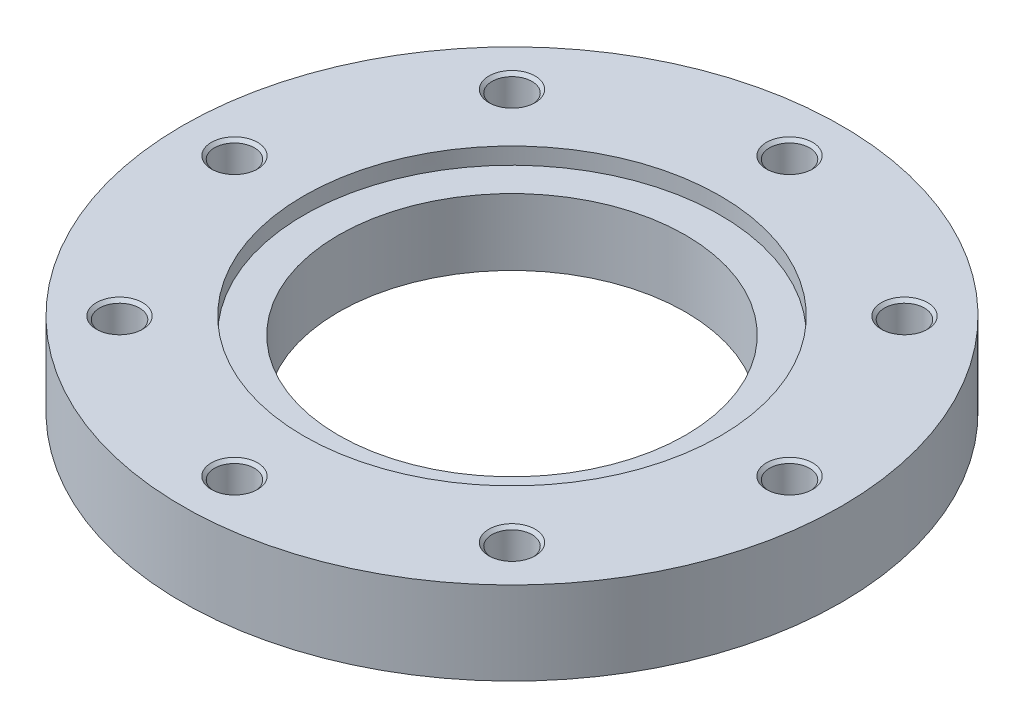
ISO-10303-21;
HEADER;
FILE_DESCRIPTION(('STEP AP214'),'2;1');
FILE_NAME('part.step','',(''),(''),'','','');
FILE_SCHEMA(('AUTOMOTIVE_DESIGN { 1 0 10303 214 1 1 1 1 }'));
ENDSEC;
DATA;
#1=APPLICATION_CONTEXT('core data for automotive mechanical design processes');
#2=APPLICATION_PROTOCOL_DEFINITION('international standard','automotive_design',2000,#1);
#3=PRODUCT_CONTEXT('',#1,'mechanical');
#4=PRODUCT('Part','Part','',(#3));
#5=PRODUCT_RELATED_PRODUCT_CATEGORY('part','',(#4));
#6=PRODUCT_DEFINITION_FORMATION('','',#4);
#7=PRODUCT_DEFINITION_CONTEXT('part definition',#1,'design');
#8=PRODUCT_DEFINITION('design','',#6,#7);
#9=PRODUCT_DEFINITION_SHAPE('','',#8);
#10=(LENGTH_UNIT() NAMED_UNIT(*) SI_UNIT(.MILLI.,.METRE.));
#11=(NAMED_UNIT(*) PLANE_ANGLE_UNIT() SI_UNIT($,.RADIAN.));
#12=(NAMED_UNIT(*) SI_UNIT($,.STERADIAN.) SOLID_ANGLE_UNIT());
#13=UNCERTAINTY_MEASURE_WITH_UNIT(LENGTH_MEASURE(1.E-05),#10,'distance_accuracy_value','');
#14=(GEOMETRIC_REPRESENTATION_CONTEXT(3) GLOBAL_UNCERTAINTY_ASSIGNED_CONTEXT((#13)) GLOBAL_UNIT_ASSIGNED_CONTEXT((#10,
#11,#12)) REPRESENTATION_CONTEXT('',''));
#15=CARTESIAN_POINT('',(0.,0.,0.));
#16=DIRECTION('',(0.,0.,1.));
#17=DIRECTION('',(1.,0.,0.));
#18=AXIS2_PLACEMENT_3D('',#15,#16,#17);
#19=CARTESIAN_POINT('',(0.,18.,0.));
#20=DIRECTION('',(0.,-1.,0.));
#21=DIRECTION('',(1.,0.,0.));
#22=AXIS2_PLACEMENT_3D('',#19,#20,#21);
#23=CYLINDRICAL_SURFACE('',#22,142.5);
#24=CARTESIAN_POINT('',(0.,0.,0.));
#25=DIRECTION('',(0.,1.,0.));
#26=DIRECTION('',(1.,0.,0.));
#27=AXIS2_PLACEMENT_3D('',#24,#25,#26);
#28=CIRCLE('',#27,142.5);
#29=CARTESIAN_POINT('',(142.5,0.,0.));
#30=VERTEX_POINT('',#29);
#31=EDGE_CURVE('E9',#30,#30,#28,.T.);
#32=ORIENTED_EDGE('',*,*,#31,.T.);
#33=EDGE_LOOP('',(#32));
#34=FACE_BOUND('',#33,.T.);
#35=CARTESIAN_POINT('',(0.,36.,0.));
#36=DIRECTION('',(0.,1.,0.));
#37=DIRECTION('',(1.,0.,0.));
#38=AXIS2_PLACEMENT_3D('',#35,#36,#37);
#39=CIRCLE('',#38,142.5);
#40=CARTESIAN_POINT('',(142.5,36.,0.));
#41=VERTEX_POINT('',#40);
#42=EDGE_CURVE('E239',#41,#41,#39,.T.);
#43=ORIENTED_EDGE('',*,*,#42,.F.);
#44=EDGE_LOOP('',(#43));
#45=FACE_BOUND('',#44,.T.);
#46=ADVANCED_FACE('F15',(#34,#45),#23,.T.);
#47=CARTESIAN_POINT('',(108.75,0.,0.));
#48=DIRECTION('',(0.,-1.,0.));
#49=DIRECTION('',(-1.,0.,0.));
#50=AXIS2_PLACEMENT_3D('',#47,#48,#49);
#51=PLANE('',#50);
#52=CARTESIAN_POINT('',(0.,0.,0.));
#53=DIRECTION('',(0.,1.,0.));
#54=DIRECTION('',(1.,0.,0.));
#55=AXIS2_PLACEMENT_3D('',#52,#53,#54);
#56=CIRCLE('',#55,75.);
#57=CARTESIAN_POINT('',(75.,0.,0.));
#58=VERTEX_POINT('',#57);
#59=EDGE_CURVE('E22',#58,#58,#56,.T.);
#60=ORIENTED_EDGE('',*,*,#59,.T.);
#61=EDGE_LOOP('',(#60));
#62=FACE_BOUND('',#61,.T.);
#63=ORIENTED_EDGE('',*,*,#31,.F.);
#64=EDGE_LOOP('',(#63));
#65=FACE_BOUND('',#64,.T.);
#66=ADVANCED_FACE('F268',(#62,#65),#51,.T.);
#67=CARTESIAN_POINT('',(0.,18.,0.));
#68=DIRECTION('',(0.,-1.,0.));
#69=DIRECTION('',(1.,0.,0.));
#70=AXIS2_PLACEMENT_3D('',#67,#68,#69);
#71=CYLINDRICAL_SURFACE('',#70,75.);
#72=ORIENTED_EDGE('',*,*,#59,.F.);
#73=EDGE_LOOP('',(#72));
#74=FACE_BOUND('',#73,.T.);
#75=CARTESIAN_POINT('',(0.,28.8,0.));
#76=DIRECTION('',(0.,1.,0.));
#77=DIRECTION('',(1.,0.,0.));
#78=AXIS2_PLACEMENT_3D('',#75,#76,#77);
#79=CIRCLE('',#78,75.);
#80=CARTESIAN_POINT('',(-75.,28.8,0.));
#81=VERTEX_POINT('',#80);
#82=EDGE_CURVE('E149',#81,#81,#79,.T.);
#83=ORIENTED_EDGE('',*,*,#82,.T.);
#84=EDGE_LOOP('',(#83));
#85=FACE_BOUND('',#84,.T.);
#86=ADVANCED_FACE('F273',(#74,#85),#71,.F.);
#87=CARTESIAN_POINT('',(108.75,36.,0.));
#88=DIRECTION('',(0.,1.,0.));
#89=DIRECTION('',(1.,0.,0.));
#90=AXIS2_PLACEMENT_3D('',#87,#88,#89);
#91=PLANE('',#90);
#92=ORIENTED_EDGE('',*,*,#42,.T.);
#93=EDGE_LOOP('',(#92));
#94=FACE_BOUND('',#93,.T.);
#95=CARTESIAN_POINT('',(0.,36.,0.));
#96=DIRECTION('',(0.,-1.,0.));
#97=DIRECTION('',(1.,0.,0.));
#98=AXIS2_PLACEMENT_3D('',#95,#96,#97);
#99=CIRCLE('',#98,90.);
#100=CARTESIAN_POINT('',(-90.,36.,0.));
#101=VERTEX_POINT('',#100);
#102=EDGE_CURVE('E259',#101,#101,#99,.T.);
#103=ORIENTED_EDGE('',*,*,#102,.T.);
#104=EDGE_LOOP('',(#103));
#105=FACE_BOUND('',#104,.T.);
#106=CARTESIAN_POINT('',(120.,36.,0.));
#107=DIRECTION('',(0.,-1.,0.));
#108=DIRECTION('',(1.,0.,0.));
#109=AXIS2_PLACEMENT_3D('',#106,#107,#108);
#110=CIRCLE('',#109,10.);
#111=CARTESIAN_POINT('',(130.,36.,0.));
#112=VERTEX_POINT('',#111);
#113=EDGE_CURVE('E220',#112,#112,#110,.T.);
#114=ORIENTED_EDGE('',*,*,#113,.T.);
#115=EDGE_LOOP('',(#114));
#116=FACE_BOUND('',#115,.T.);
#117=CARTESIAN_POINT('',(84.8528137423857,36.,-84.8528137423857));
#118=DIRECTION('',(0.,-1.,0.));
#119=DIRECTION('',(0.707106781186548,0.,-0.707106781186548));
#120=AXIS2_PLACEMENT_3D('',#117,#118,#119);
#121=CIRCLE('',#120,10.);
#122=CARTESIAN_POINT('',(91.9238815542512,36.,-91.9238815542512));
#123=VERTEX_POINT('',#122);
#124=EDGE_CURVE('E201',#123,#123,#121,.T.);
#125=ORIENTED_EDGE('',*,*,#124,.T.);
#126=EDGE_LOOP('',(#125));
#127=FACE_BOUND('',#126,.T.);
#128=CARTESIAN_POINT('',(0.,36.,-120.));
#129=DIRECTION('',(0.,-1.,0.));
#130=DIRECTION('',(0.,0.,-1.));
#131=AXIS2_PLACEMENT_3D('',#128,#129,#130);
#132=CIRCLE('',#131,10.);
#133=CARTESIAN_POINT('',(0.,36.,-130.));
#134=VERTEX_POINT('',#133);
#135=EDGE_CURVE('E237',#134,#134,#132,.T.);
#136=ORIENTED_EDGE('',*,*,#135,.T.);
#137=EDGE_LOOP('',(#136));
#138=FACE_BOUND('',#137,.T.);
#139=CARTESIAN_POINT('',(-84.8528137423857,36.,-84.8528137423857));
#140=DIRECTION('',(0.,-1.,0.));
#141=DIRECTION('',(-0.707106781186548,0.,-0.707106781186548));
#142=AXIS2_PLACEMENT_3D('',#139,#140,#141);
#143=CIRCLE('',#142,10.);
#144=CARTESIAN_POINT('',(-91.9238815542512,36.,-91.9238815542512));
#145=VERTEX_POINT('',#144);
#146=EDGE_CURVE('E219',#145,#145,#143,.T.);
#147=ORIENTED_EDGE('',*,*,#146,.T.);
#148=EDGE_LOOP('',(#147));
#149=FACE_BOUND('',#148,.T.);
#150=CARTESIAN_POINT('',(-120.,36.,0.));
#151=DIRECTION('',(0.,-1.,0.));
#152=DIRECTION('',(-1.,0.,0.));
#153=AXIS2_PLACEMENT_3D('',#150,#151,#152);
#154=CIRCLE('',#153,10.);
#155=CARTESIAN_POINT('',(-130.,36.,0.));
#156=VERTEX_POINT('',#155);
#157=EDGE_CURVE('E194',#156,#156,#154,.T.);
#158=ORIENTED_EDGE('',*,*,#157,.T.);
#159=EDGE_LOOP('',(#158));
#160=FACE_BOUND('',#159,.T.);
#161=CARTESIAN_POINT('',(-84.8528137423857,36.,84.8528137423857));
#162=DIRECTION('',(0.,-1.,0.));
#163=DIRECTION('',(-0.707106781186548,0.,0.707106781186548));
#164=AXIS2_PLACEMENT_3D('',#161,#162,#163);
#165=CIRCLE('',#164,10.);
#166=CARTESIAN_POINT('',(-91.9238815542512,36.,91.9238815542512));
#167=VERTEX_POINT('',#166);
#168=EDGE_CURVE('E508',#167,#167,#165,.T.);
#169=ORIENTED_EDGE('',*,*,#168,.T.);
#170=EDGE_LOOP('',(#169));
#171=FACE_BOUND('',#170,.T.);
#172=CARTESIAN_POINT('',(0.,36.,120.));
#173=DIRECTION('',(0.,-1.,0.));
#174=DIRECTION('',(0.,0.,1.));
#175=AXIS2_PLACEMENT_3D('',#172,#173,#174);
#176=CIRCLE('',#175,10.);
#177=CARTESIAN_POINT('',(0.,36.,130.));
#178=VERTEX_POINT('',#177);
#179=EDGE_CURVE('E495',#178,#178,#176,.T.);
#180=ORIENTED_EDGE('',*,*,#179,.T.);
#181=EDGE_LOOP('',(#180));
#182=FACE_BOUND('',#181,.T.);
#183=CARTESIAN_POINT('',(84.8528137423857,36.,84.8528137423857));
#184=DIRECTION('',(0.,-1.,0.));
#185=DIRECTION('',(0.707106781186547,0.,0.707106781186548));
#186=AXIS2_PLACEMENT_3D('',#183,#184,#185);
#187=CIRCLE('',#186,10.);
#188=CARTESIAN_POINT('',(91.9238815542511,36.,91.9238815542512));
#189=VERTEX_POINT('',#188);
#190=EDGE_CURVE('E504',#189,#189,#187,.T.);
#191=ORIENTED_EDGE('',*,*,#190,.T.);
#192=EDGE_LOOP('',(#191));
#193=FACE_BOUND('',#192,.T.);
#194=ADVANCED_FACE('F264',(#94,#105,#116,#127,#138,#149,#160,#171,#182,#193),#91,.T.);
#195=CARTESIAN_POINT('',(0.,28.8,0.));
#196=DIRECTION('',(0.,-1.,0.));
#197=DIRECTION('',(-1.,0.,0.));
#198=AXIS2_PLACEMENT_3D('',#195,#196,#197);
#199=PLANE('',#198);
#200=CARTESIAN_POINT('',(0.,28.8,0.));
#201=DIRECTION('',(0.,-1.,0.));
#202=DIRECTION('',(1.,0.,0.));
#203=AXIS2_PLACEMENT_3D('',#200,#201,#202);
#204=CIRCLE('',#203,90.);
#205=CARTESIAN_POINT('',(90.,28.8,0.));
#206=VERTEX_POINT('',#205);
#207=EDGE_CURVE('E154',#206,#206,#204,.T.);
#208=ORIENTED_EDGE('',*,*,#207,.F.);
#209=EDGE_LOOP('',(#208));
#210=FACE_BOUND('',#209,.T.);
#211=ORIENTED_EDGE('',*,*,#82,.F.);
#212=EDGE_LOOP('',(#211));
#213=FACE_BOUND('',#212,.T.);
#214=ADVANCED_FACE('F283',(#210,#213),#199,.F.);
#215=CARTESIAN_POINT('',(0.,34.2,0.));
#216=DIRECTION('',(0.,-1.,0.));
#217=DIRECTION('',(1.,0.,0.));
#218=AXIS2_PLACEMENT_3D('',#215,#216,#217);
#219=CYLINDRICAL_SURFACE('',#218,90.);
#220=ORIENTED_EDGE('',*,*,#207,.T.);
#221=EDGE_LOOP('',(#220));
#222=FACE_BOUND('',#221,.T.);
#223=ORIENTED_EDGE('',*,*,#102,.F.);
#224=EDGE_LOOP('',(#223));
#225=FACE_BOUND('',#224,.T.);
#226=ADVANCED_FACE('F286',(#222,#225),#219,.F.);
#227=CARTESIAN_POINT('',(120.,5.50386219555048,0.));
#228=DIRECTION('',(0.,1.,0.));
#229=DIRECTION('',(1.,0.,0.));
#230=AXIS2_PLACEMENT_3D('',#227,#228,#229);
#231=CONICAL_SURFACE('',#230,4.3234375,1.0471975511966);
#232=CARTESIAN_POINT('',(120.,8.,0.));
#233=DIRECTION('',(0.,-1.,0.));
#234=DIRECTION('',(1.,0.,0.));
#235=AXIS2_PLACEMENT_3D('',#232,#233,#234);
#236=CIRCLE('',#235,8.646875);
#237=CARTESIAN_POINT('',(128.646875,8.,0.));
#238=VERTEX_POINT('',#237);
#239=EDGE_CURVE('E257',#238,#238,#236,.T.);
#240=ORIENTED_EDGE('',*,*,#239,.F.);
#241=EDGE_LOOP('',(#240));
#242=FACE_BOUND('',#241,.T.);
#243=CARTESIAN_POINT('',(120.,3.00772439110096,0.));
#244=VERTEX_POINT('',#243);
#245=VERTEX_LOOP('',#244);
#246=FACE_BOUND('',#245,.T.);
#247=ADVANCED_FACE('F290',(#242,#246),#231,.F.);
#248=CARTESIAN_POINT('',(120.,11.3234375,0.));
#249=DIRECTION('',(0.,1.,0.));
#250=DIRECTION('',(1.,0.,0.));
#251=AXIS2_PLACEMENT_3D('',#248,#249,#250);
#252=CYLINDRICAL_SURFACE('',#251,8.646875);
#253=CARTESIAN_POINT('',(120.,14.646875,0.));
#254=DIRECTION('',(0.,-1.,0.));
#255=DIRECTION('',(1.,0.,0.));
#256=AXIS2_PLACEMENT_3D('',#253,#254,#255);
#257=CIRCLE('',#256,8.646875);
#258=CARTESIAN_POINT('',(128.646875,14.646875,0.));
#259=VERTEX_POINT('',#258);
#260=EDGE_CURVE('E255',#259,#259,#257,.T.);
#261=ORIENTED_EDGE('',*,*,#260,.F.);
#262=EDGE_LOOP('',(#261));
#263=FACE_BOUND('',#262,.T.);
#264=ORIENTED_EDGE('',*,*,#239,.T.);
#265=EDGE_LOOP('',(#264));
#266=FACE_BOUND('',#265,.T.);
#267=ADVANCED_FACE('F293',(#263,#266),#252,.F.);
#268=CARTESIAN_POINT('',(120.,15.3234375,0.));
#269=DIRECTION('',(0.,1.,0.));
#270=DIRECTION('',(1.,0.,0.));
#271=AXIS2_PLACEMENT_3D('',#268,#269,#270);
#272=CONICAL_SURFACE('',#271,9.3234375,0.785398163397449);
#273=CARTESIAN_POINT('',(120.,16.,0.));
#274=DIRECTION('',(0.,-1.,0.));
#275=DIRECTION('',(1.,0.,0.));
#276=AXIS2_PLACEMENT_3D('',#273,#274,#275);
#277=CIRCLE('',#276,10.);
#278=CARTESIAN_POINT('',(130.,16.,0.));
#279=VERTEX_POINT('',#278);
#280=EDGE_CURVE('E253',#279,#279,#277,.T.);
#281=ORIENTED_EDGE('',*,*,#280,.F.);
#282=EDGE_LOOP('',(#281));
#283=FACE_BOUND('',#282,.T.);
#284=ORIENTED_EDGE('',*,*,#260,.T.);
#285=EDGE_LOOP('',(#284));
#286=FACE_BOUND('',#285,.T.);
#287=ADVANCED_FACE('F295',(#283,#286),#272,.F.);
#288=CARTESIAN_POINT('',(129.3234375,16.,0.));
#289=DIRECTION('',(0.,1.,0.));
#290=DIRECTION('',(-1.,0.,0.));
#291=AXIS2_PLACEMENT_3D('',#288,#289,#290);
#292=PLANE('',#291);
#293=CARTESIAN_POINT('',(120.,16.,0.));
#294=DIRECTION('',(0.,-1.,0.));
#295=DIRECTION('',(1.,0.,0.));
#296=AXIS2_PLACEMENT_3D('',#293,#294,#295);
#297=CIRCLE('',#296,8.646875);
#298=CARTESIAN_POINT('',(128.646875,16.,0.));
#299=VERTEX_POINT('',#298);
#300=EDGE_CURVE('E222',#299,#299,#297,.T.);
#301=ORIENTED_EDGE('',*,*,#300,.F.);
#302=EDGE_LOOP('',(#301));
#303=FACE_BOUND('',#302,.T.);
#304=ORIENTED_EDGE('',*,*,#280,.T.);
#305=EDGE_LOOP('',(#304));
#306=FACE_BOUND('',#305,.T.);
#307=ADVANCED_FACE('F298',(#303,#306),#292,.F.);
#308=CARTESIAN_POINT('',(120.,25.3234375,0.));
#309=DIRECTION('',(0.,1.,0.));
#310=DIRECTION('',(1.,0.,0.));
#311=AXIS2_PLACEMENT_3D('',#308,#309,#310);
#312=CYLINDRICAL_SURFACE('',#311,8.646875);
#313=CARTESIAN_POINT('',(120.,34.646875,0.));
#314=DIRECTION('',(0.,-1.,0.));
#315=DIRECTION('',(1.,0.,0.));
#316=AXIS2_PLACEMENT_3D('',#313,#314,#315);
#317=CIRCLE('',#316,8.646875);
#318=CARTESIAN_POINT('',(128.646875,34.646875,0.));
#319=VERTEX_POINT('',#318);
#320=EDGE_CURVE('E214',#319,#319,#317,.T.);
#321=ORIENTED_EDGE('',*,*,#320,.F.);
#322=EDGE_LOOP('',(#321));
#323=FACE_BOUND('',#322,.T.);
#324=ORIENTED_EDGE('',*,*,#300,.T.);
#325=EDGE_LOOP('',(#324));
#326=FACE_BOUND('',#325,.T.);
#327=ADVANCED_FACE('F302',(#323,#326),#312,.F.);
#328=CARTESIAN_POINT('',(120.,35.3234375,0.));
#329=DIRECTION('',(0.,1.,0.));
#330=DIRECTION('',(1.,0.,0.));
#331=AXIS2_PLACEMENT_3D('',#328,#329,#330);
#332=CONICAL_SURFACE('',#331,9.3234375,0.785398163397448);
#333=ORIENTED_EDGE('',*,*,#113,.F.);
#334=EDGE_LOOP('',(#333));
#335=FACE_BOUND('',#334,.T.);
#336=ORIENTED_EDGE('',*,*,#320,.T.);
#337=EDGE_LOOP('',(#336));
#338=FACE_BOUND('',#337,.T.);
#339=ADVANCED_FACE('F306',(#335,#338),#332,.F.);
#340=CARTESIAN_POINT('',(84.8528137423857,5.50386219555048,-84.8528137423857));
#341=DIRECTION('',(0.,1.,0.));
#342=DIRECTION('',(0.707106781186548,0.,-0.707106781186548));
#343=AXIS2_PLACEMENT_3D('',#340,#341,#342);
#344=CONICAL_SURFACE('',#343,4.3234375,1.0471975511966);
#345=CARTESIAN_POINT('',(84.8528137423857,8.,-84.8528137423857));
#346=DIRECTION('',(0.,-1.,0.));
#347=DIRECTION('',(0.707106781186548,0.,-0.707106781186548));
#348=AXIS2_PLACEMENT_3D('',#345,#346,#347);
#349=CIRCLE('',#348,8.646875);
#350=CARTESIAN_POINT('',(90.9670776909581,8.,-90.9670776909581));
#351=VERTEX_POINT('',#350);
#352=EDGE_CURVE('E212',#351,#351,#349,.T.);
#353=ORIENTED_EDGE('',*,*,#352,.F.);
#354=EDGE_LOOP('',(#353));
#355=FACE_BOUND('',#354,.T.);
#356=CARTESIAN_POINT('',(84.8528137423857,3.00772439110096,-84.8528137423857));
#357=VERTEX_POINT('',#356);
#358=VERTEX_LOOP('',#357);
#359=FACE_BOUND('',#358,.T.);
#360=ADVANCED_FACE('F308',(#355,#359),#344,.F.);
#361=CARTESIAN_POINT('',(84.8528137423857,11.3234375,-84.8528137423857));
#362=DIRECTION('',(0.,1.,0.));
#363=DIRECTION('',(0.707106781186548,0.,-0.707106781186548));
#364=AXIS2_PLACEMENT_3D('',#361,#362,#363);
#365=CYLINDRICAL_SURFACE('',#364,8.646875);
#366=CARTESIAN_POINT('',(84.8528137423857,14.646875,-84.8528137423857));
#367=DIRECTION('',(0.,-1.,0.));
#368=DIRECTION('',(0.707106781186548,0.,-0.707106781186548));
#369=AXIS2_PLACEMENT_3D('',#366,#367,#368);
#370=CIRCLE('',#369,8.646875);
#371=CARTESIAN_POINT('',(90.9670776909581,14.646875,-90.9670776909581));
#372=VERTEX_POINT('',#371);
#373=EDGE_CURVE('E215',#372,#372,#370,.T.);
#374=ORIENTED_EDGE('',*,*,#373,.F.);
#375=EDGE_LOOP('',(#374));
#376=FACE_BOUND('',#375,.T.);
#377=ORIENTED_EDGE('',*,*,#352,.T.);
#378=EDGE_LOOP('',(#377));
#379=FACE_BOUND('',#378,.T.);
#380=ADVANCED_FACE('F311',(#376,#379),#365,.F.);
#381=CARTESIAN_POINT('',(84.8528137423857,15.3234375,-84.8528137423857));
#382=DIRECTION('',(0.,1.,0.));
#383=DIRECTION('',(0.707106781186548,0.,-0.707106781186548));
#384=AXIS2_PLACEMENT_3D('',#381,#382,#383);
#385=CONICAL_SURFACE('',#384,9.3234375,0.785398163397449);
#386=CARTESIAN_POINT('',(84.8528137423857,16.,-84.8528137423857));
#387=DIRECTION('',(0.,-1.,0.));
#388=DIRECTION('',(0.707106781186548,0.,-0.707106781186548));
#389=AXIS2_PLACEMENT_3D('',#386,#387,#388);
#390=CIRCLE('',#389,10.);
#391=CARTESIAN_POINT('',(91.9238815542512,16.,-91.9238815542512));
#392=VERTEX_POINT('',#391);
#393=EDGE_CURVE('E229',#392,#392,#390,.T.);
#394=ORIENTED_EDGE('',*,*,#393,.F.);
#395=EDGE_LOOP('',(#394));
#396=FACE_BOUND('',#395,.T.);
#397=ORIENTED_EDGE('',*,*,#373,.T.);
#398=EDGE_LOOP('',(#397));
#399=FACE_BOUND('',#398,.T.);
#400=ADVANCED_FACE('F315',(#396,#399),#385,.F.);
#401=CARTESIAN_POINT('',(91.4454796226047,16.,-91.4454796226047));
#402=DIRECTION('',(0.,1.,0.));
#403=DIRECTION('',(-0.707106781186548,0.,0.707106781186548));
#404=AXIS2_PLACEMENT_3D('',#401,#402,#403);
#405=PLANE('',#404);
#406=CARTESIAN_POINT('',(84.8528137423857,16.,-84.8528137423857));
#407=DIRECTION('',(0.,-1.,0.));
#408=DIRECTION('',(0.707106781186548,0.,-0.707106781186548));
#409=AXIS2_PLACEMENT_3D('',#406,#407,#408);
#410=CIRCLE('',#409,8.646875);
#411=CARTESIAN_POINT('',(90.9670776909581,16.,-90.9670776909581));
#412=VERTEX_POINT('',#411);
#413=EDGE_CURVE('E227',#412,#412,#410,.T.);
#414=ORIENTED_EDGE('',*,*,#413,.F.);
#415=EDGE_LOOP('',(#414));
#416=FACE_BOUND('',#415,.T.);
#417=ORIENTED_EDGE('',*,*,#393,.T.);
#418=EDGE_LOOP('',(#417));
#419=FACE_BOUND('',#418,.T.);
#420=ADVANCED_FACE('F319',(#416,#419),#405,.F.);
#421=CARTESIAN_POINT('',(84.8528137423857,25.3234375,-84.8528137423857));
#422=DIRECTION('',(0.,1.,0.));
#423=DIRECTION('',(0.707106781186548,0.,-0.707106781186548));
#424=AXIS2_PLACEMENT_3D('',#421,#422,#423);
#425=CYLINDRICAL_SURFACE('',#424,8.646875);
#426=CARTESIAN_POINT('',(84.8528137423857,34.646875,-84.8528137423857));
#427=DIRECTION('',(0.,-1.,0.));
#428=DIRECTION('',(0.707106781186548,0.,-0.707106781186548));
#429=AXIS2_PLACEMENT_3D('',#426,#427,#428);
#430=CIRCLE('',#429,8.646875);
#431=CARTESIAN_POINT('',(90.9670776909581,34.646875,-90.9670776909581));
#432=VERTEX_POINT('',#431);
#433=EDGE_CURVE('E200',#432,#432,#430,.T.);
#434=ORIENTED_EDGE('',*,*,#433,.F.);
#435=EDGE_LOOP('',(#434));
#436=FACE_BOUND('',#435,.T.);
#437=ORIENTED_EDGE('',*,*,#413,.T.);
#438=EDGE_LOOP('',(#437));
#439=FACE_BOUND('',#438,.T.);
#440=ADVANCED_FACE('F323',(#436,#439),#425,.F.);
#441=CARTESIAN_POINT('',(84.8528137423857,35.3234375,-84.8528137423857));
#442=DIRECTION('',(0.,1.,0.));
#443=DIRECTION('',(0.707106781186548,0.,-0.707106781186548));
#444=AXIS2_PLACEMENT_3D('',#441,#442,#443);
#445=CONICAL_SURFACE('',#444,9.3234375,0.785398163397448);
#446=ORIENTED_EDGE('',*,*,#124,.F.);
#447=EDGE_LOOP('',(#446));
#448=FACE_BOUND('',#447,.T.);
#449=ORIENTED_EDGE('',*,*,#433,.T.);
#450=EDGE_LOOP('',(#449));
#451=FACE_BOUND('',#450,.T.);
#452=ADVANCED_FACE('F325',(#448,#451),#445,.F.);
#453=CARTESIAN_POINT('',(0.,5.50386219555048,-120.));
#454=DIRECTION('',(0.,1.,0.));
#455=DIRECTION('',(0.,0.,-1.));
#456=AXIS2_PLACEMENT_3D('',#453,#454,#455);
#457=CONICAL_SURFACE('',#456,4.3234375,1.0471975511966);
#458=CARTESIAN_POINT('',(0.,8.,-120.));
#459=DIRECTION('',(0.,-1.,0.));
#460=DIRECTION('',(0.,0.,-1.));
#461=AXIS2_PLACEMENT_3D('',#458,#459,#460);
#462=CIRCLE('',#461,8.646875);
#463=CARTESIAN_POINT('',(0.,8.,-128.646875));
#464=VERTEX_POINT('',#463);
#465=EDGE_CURVE('E202',#464,#464,#462,.T.);
#466=ORIENTED_EDGE('',*,*,#465,.F.);
#467=EDGE_LOOP('',(#466));
#468=FACE_BOUND('',#467,.T.);
#469=CARTESIAN_POINT('',(0.,3.00772439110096,-120.));
#470=VERTEX_POINT('',#469);
#471=VERTEX_LOOP('',#470);
#472=FACE_BOUND('',#471,.T.);
#473=ADVANCED_FACE('F328',(#468,#472),#457,.F.);
#474=CARTESIAN_POINT('',(0.,11.3234375,-120.));
#475=DIRECTION('',(0.,1.,0.));
#476=DIRECTION('',(0.,0.,-1.));
#477=AXIS2_PLACEMENT_3D('',#474,#475,#476);
#478=CYLINDRICAL_SURFACE('',#477,8.646875);
#479=CARTESIAN_POINT('',(0.,14.646875,-120.));
#480=DIRECTION('',(0.,-1.,0.));
#481=DIRECTION('',(0.,0.,-1.));
#482=AXIS2_PLACEMENT_3D('',#479,#480,#481);
#483=CIRCLE('',#482,8.646875);
#484=CARTESIAN_POINT('',(0.,14.646875,-128.646875));
#485=VERTEX_POINT('',#484);
#486=EDGE_CURVE('E245',#485,#485,#483,.T.);
#487=ORIENTED_EDGE('',*,*,#486,.F.);
#488=EDGE_LOOP('',(#487));
#489=FACE_BOUND('',#488,.T.);
#490=ORIENTED_EDGE('',*,*,#465,.T.);
#491=EDGE_LOOP('',(#490));
#492=FACE_BOUND('',#491,.T.);
#493=ADVANCED_FACE('F332',(#489,#492),#478,.F.);
#494=CARTESIAN_POINT('',(0.,15.3234375,-120.));
#495=DIRECTION('',(0.,1.,0.));
#496=DIRECTION('',(0.,0.,-1.));
#497=AXIS2_PLACEMENT_3D('',#494,#495,#496);
#498=CONICAL_SURFACE('',#497,9.3234375,0.785398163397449);
#499=CARTESIAN_POINT('',(0.,16.,-120.));
#500=DIRECTION('',(0.,-1.,0.));
#501=DIRECTION('',(0.,0.,-1.));
#502=AXIS2_PLACEMENT_3D('',#499,#500,#501);
#503=CIRCLE('',#502,10.);
#504=CARTESIAN_POINT('',(0.,16.,-130.));
#505=VERTEX_POINT('',#504);
#506=EDGE_CURVE('E243',#505,#505,#503,.T.);
#507=ORIENTED_EDGE('',*,*,#506,.F.);
#508=EDGE_LOOP('',(#507));
#509=FACE_BOUND('',#508,.T.);
#510=ORIENTED_EDGE('',*,*,#486,.T.);
#511=EDGE_LOOP('',(#510));
#512=FACE_BOUND('',#511,.T.);
#513=ADVANCED_FACE('F336',(#509,#512),#498,.F.);
#514=CARTESIAN_POINT('',(0.,16.,-129.3234375));
#515=DIRECTION('',(0.,1.,0.));
#516=DIRECTION('',(0.,0.,1.));
#517=AXIS2_PLACEMENT_3D('',#514,#515,#516);
#518=PLANE('',#517);
#519=CARTESIAN_POINT('',(0.,16.,-120.));
#520=DIRECTION('',(0.,-1.,0.));
#521=DIRECTION('',(0.,0.,-1.));
#522=AXIS2_PLACEMENT_3D('',#519,#520,#521);
#523=CIRCLE('',#522,8.646875);
#524=CARTESIAN_POINT('',(0.,16.,-128.646875));
#525=VERTEX_POINT('',#524);
#526=EDGE_CURVE('E241',#525,#525,#523,.T.);
#527=ORIENTED_EDGE('',*,*,#526,.F.);
#528=EDGE_LOOP('',(#527));
#529=FACE_BOUND('',#528,.T.);
#530=ORIENTED_EDGE('',*,*,#506,.T.);
#531=EDGE_LOOP('',(#530));
#532=FACE_BOUND('',#531,.T.);
#533=ADVANCED_FACE('F338',(#529,#532),#518,.F.);
#534=CARTESIAN_POINT('',(0.,25.3234375,-120.));
#535=DIRECTION('',(0.,1.,0.));
#536=DIRECTION('',(0.,0.,-1.));
#537=AXIS2_PLACEMENT_3D('',#534,#535,#536);
#538=CYLINDRICAL_SURFACE('',#537,8.646875);
#539=CARTESIAN_POINT('',(0.,34.646875,-120.));
#540=DIRECTION('',(0.,-1.,0.));
#541=DIRECTION('',(0.,0.,-1.));
#542=AXIS2_PLACEMENT_3D('',#539,#540,#541);
#543=CIRCLE('',#542,8.646875);
#544=CARTESIAN_POINT('',(0.,34.646875,-128.646875));
#545=VERTEX_POINT('',#544);
#546=EDGE_CURVE('E235',#545,#545,#543,.T.);
#547=ORIENTED_EDGE('',*,*,#546,.F.);
#548=EDGE_LOOP('',(#547));
#549=FACE_BOUND('',#548,.T.);
#550=ORIENTED_EDGE('',*,*,#526,.T.);
#551=EDGE_LOOP('',(#550));
#552=FACE_BOUND('',#551,.T.);
#553=ADVANCED_FACE('F341',(#549,#552),#538,.F.);
#554=CARTESIAN_POINT('',(0.,35.3234375,-120.));
#555=DIRECTION('',(0.,1.,0.));
#556=DIRECTION('',(0.,0.,-1.));
#557=AXIS2_PLACEMENT_3D('',#554,#555,#556);
#558=CONICAL_SURFACE('',#557,9.3234375,0.785398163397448);
#559=ORIENTED_EDGE('',*,*,#135,.F.);
#560=EDGE_LOOP('',(#559));
#561=FACE_BOUND('',#560,.T.);
#562=ORIENTED_EDGE('',*,*,#546,.T.);
#563=EDGE_LOOP('',(#562));
#564=FACE_BOUND('',#563,.T.);
#565=ADVANCED_FACE('F345',(#561,#564),#558,.F.);
#566=CARTESIAN_POINT('',(-84.8528137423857,5.50386219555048,-84.8528137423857));
#567=DIRECTION('',(0.,1.,0.));
#568=DIRECTION('',(-0.707106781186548,0.,-0.707106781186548));
#569=AXIS2_PLACEMENT_3D('',#566,#567,#568);
#570=CONICAL_SURFACE('',#569,4.3234375,1.0471975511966);
#571=CARTESIAN_POINT('',(-84.8528137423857,8.,-84.8528137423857));
#572=DIRECTION('',(0.,-1.,0.));
#573=DIRECTION('',(-0.707106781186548,0.,-0.707106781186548));
#574=AXIS2_PLACEMENT_3D('',#571,#572,#573);
#575=CIRCLE('',#574,8.646875);
#576=CARTESIAN_POINT('',(-90.9670776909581,8.,-90.9670776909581));
#577=VERTEX_POINT('',#576);
#578=EDGE_CURVE('E233',#577,#577,#575,.T.);
#579=ORIENTED_EDGE('',*,*,#578,.F.);
#580=EDGE_LOOP('',(#579));
#581=FACE_BOUND('',#580,.T.);
#582=CARTESIAN_POINT('',(-84.8528137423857,3.00772439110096,-84.8528137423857));
#583=VERTEX_POINT('',#582);
#584=VERTEX_LOOP('',#583);
#585=FACE_BOUND('',#584,.T.);
#586=ADVANCED_FACE('F349',(#581,#585),#570,.F.);
#587=CARTESIAN_POINT('',(-84.8528137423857,11.3234375,-84.8528137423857));
#588=DIRECTION('',(0.,1.,0.));
#589=DIRECTION('',(-0.707106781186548,0.,-0.707106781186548));
#590=AXIS2_PLACEMENT_3D('',#587,#588,#589);
#591=CYLINDRICAL_SURFACE('',#590,8.646875);
#592=CARTESIAN_POINT('',(-84.8528137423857,14.646875,-84.8528137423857));
#593=DIRECTION('',(0.,-1.,0.));
#594=DIRECTION('',(-0.707106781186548,0.,-0.707106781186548));
#595=AXIS2_PLACEMENT_3D('',#592,#593,#594);
#596=CIRCLE('',#595,8.646875);
#597=CARTESIAN_POINT('',(-90.9670776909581,14.646875,-90.9670776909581));
#598=VERTEX_POINT('',#597);
#599=EDGE_CURVE('E231',#598,#598,#596,.T.);
#600=ORIENTED_EDGE('',*,*,#599,.F.);
#601=EDGE_LOOP('',(#600));
#602=FACE_BOUND('',#601,.T.);
#603=ORIENTED_EDGE('',*,*,#578,.T.);
#604=EDGE_LOOP('',(#603));
#605=FACE_BOUND('',#604,.T.);
#606=ADVANCED_FACE('F353',(#602,#605),#591,.F.);
#607=CARTESIAN_POINT('',(-84.8528137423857,15.3234375,-84.8528137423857));
#608=DIRECTION('',(0.,1.,0.));
#609=DIRECTION('',(-0.707106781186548,0.,-0.707106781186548));
#610=AXIS2_PLACEMENT_3D('',#607,#608,#609);
#611=CONICAL_SURFACE('',#610,9.3234375,0.785398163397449);
#612=CARTESIAN_POINT('',(-84.8528137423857,16.,-84.8528137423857));
#613=DIRECTION('',(0.,-1.,0.));
#614=DIRECTION('',(-0.707106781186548,0.,-0.707106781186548));
#615=AXIS2_PLACEMENT_3D('',#612,#613,#614);
#616=CIRCLE('',#615,10.);
#617=CARTESIAN_POINT('',(-91.9238815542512,16.,-91.9238815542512));
#618=VERTEX_POINT('',#617);
#619=EDGE_CURVE('E226',#618,#618,#616,.T.);
#620=ORIENTED_EDGE('',*,*,#619,.F.);
#621=EDGE_LOOP('',(#620));
#622=FACE_BOUND('',#621,.T.);
#623=ORIENTED_EDGE('',*,*,#599,.T.);
#624=EDGE_LOOP('',(#623));
#625=FACE_BOUND('',#624,.T.);
#626=ADVANCED_FACE('F357',(#622,#625),#611,.F.);
#627=CARTESIAN_POINT('',(-91.4454796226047,16.,-91.4454796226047));
#628=DIRECTION('',(0.,1.,0.));
#629=DIRECTION('',(0.707106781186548,0.,0.707106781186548));
#630=AXIS2_PLACEMENT_3D('',#627,#628,#629);
#631=PLANE('',#630);
#632=CARTESIAN_POINT('',(-84.8528137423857,16.,-84.8528137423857));
#633=DIRECTION('',(0.,-1.,0.));
#634=DIRECTION('',(-0.707106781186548,0.,-0.707106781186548));
#635=AXIS2_PLACEMENT_3D('',#632,#633,#634);
#636=CIRCLE('',#635,8.646875);
#637=CARTESIAN_POINT('',(-90.9670776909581,16.,-90.9670776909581));
#638=VERTEX_POINT('',#637);
#639=EDGE_CURVE('E224',#638,#638,#636,.T.);
#640=ORIENTED_EDGE('',*,*,#639,.F.);
#641=EDGE_LOOP('',(#640));
#642=FACE_BOUND('',#641,.T.);
#643=ORIENTED_EDGE('',*,*,#619,.T.);
#644=EDGE_LOOP('',(#643));
#645=FACE_BOUND('',#644,.T.);
#646=ADVANCED_FACE('F364',(#642,#645),#631,.F.);
#647=CARTESIAN_POINT('',(-84.8528137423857,25.3234375,-84.8528137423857));
#648=DIRECTION('',(0.,1.,0.));
#649=DIRECTION('',(-0.707106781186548,0.,-0.707106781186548));
#650=AXIS2_PLACEMENT_3D('',#647,#648,#649);
#651=CYLINDRICAL_SURFACE('',#650,8.646875);
#652=CARTESIAN_POINT('',(-84.8528137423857,34.646875,-84.8528137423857));
#653=DIRECTION('',(0.,-1.,0.));
#654=DIRECTION('',(-0.707106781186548,0.,-0.707106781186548));
#655=AXIS2_PLACEMENT_3D('',#652,#653,#654);
#656=CIRCLE('',#655,8.646875);
#657=CARTESIAN_POINT('',(-90.9670776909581,34.646875,-90.9670776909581));
#658=VERTEX_POINT('',#657);
#659=EDGE_CURVE('E217',#658,#658,#656,.T.);
#660=ORIENTED_EDGE('',*,*,#659,.F.);
#661=EDGE_LOOP('',(#660));
#662=FACE_BOUND('',#661,.T.);
#663=ORIENTED_EDGE('',*,*,#639,.T.);
#664=EDGE_LOOP('',(#663));
#665=FACE_BOUND('',#664,.T.);
#666=ADVANCED_FACE('F368',(#662,#665),#651,.F.);
#667=CARTESIAN_POINT('',(-84.8528137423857,35.3234375,-84.8528137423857));
#668=DIRECTION('',(0.,1.,0.));
#669=DIRECTION('',(-0.707106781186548,0.,-0.707106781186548));
#670=AXIS2_PLACEMENT_3D('',#667,#668,#669);
#671=CONICAL_SURFACE('',#670,9.3234375,0.785398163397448);
#672=ORIENTED_EDGE('',*,*,#146,.F.);
#673=EDGE_LOOP('',(#672));
#674=FACE_BOUND('',#673,.T.);
#675=ORIENTED_EDGE('',*,*,#659,.T.);
#676=EDGE_LOOP('',(#675));
#677=FACE_BOUND('',#676,.T.);
#678=ADVANCED_FACE('F372',(#674,#677),#671,.F.);
#679=CARTESIAN_POINT('',(-120.,5.50386219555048,0.));
#680=DIRECTION('',(0.,1.,0.));
#681=DIRECTION('',(-1.,0.,0.));
#682=AXIS2_PLACEMENT_3D('',#679,#680,#681);
#683=CONICAL_SURFACE('',#682,4.3234375,1.0471975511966);
#684=CARTESIAN_POINT('',(-120.,8.,0.));
#685=DIRECTION('',(0.,-1.,0.));
#686=DIRECTION('',(-1.,0.,0.));
#687=AXIS2_PLACEMENT_3D('',#684,#685,#686);
#688=CIRCLE('',#687,8.646875);
#689=CARTESIAN_POINT('',(-128.646875,8.,0.));
#690=VERTEX_POINT('',#689);
#691=EDGE_CURVE('E211',#690,#690,#688,.T.);
#692=ORIENTED_EDGE('',*,*,#691,.F.);
#693=EDGE_LOOP('',(#692));
#694=FACE_BOUND('',#693,.T.);
#695=CARTESIAN_POINT('',(-120.,3.00772439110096,0.));
#696=VERTEX_POINT('',#695);
#697=VERTEX_LOOP('',#696);
#698=FACE_BOUND('',#697,.T.);
#699=ADVANCED_FACE('F376',(#694,#698),#683,.F.);
#700=CARTESIAN_POINT('',(-120.,11.3234375,0.));
#701=DIRECTION('',(0.,1.,0.));
#702=DIRECTION('',(-1.,0.,0.));
#703=AXIS2_PLACEMENT_3D('',#700,#701,#702);
#704=CYLINDRICAL_SURFACE('',#703,8.646875);
#705=CARTESIAN_POINT('',(-120.,14.646875,0.));
#706=DIRECTION('',(0.,-1.,0.));
#707=DIRECTION('',(-1.,0.,0.));
#708=AXIS2_PLACEMENT_3D('',#705,#706,#707);
#709=CIRCLE('',#708,8.646875);
#710=CARTESIAN_POINT('',(-128.646875,14.646875,0.));
#711=VERTEX_POINT('',#710);
#712=EDGE_CURVE('E209',#711,#711,#709,.T.);
#713=ORIENTED_EDGE('',*,*,#712,.F.);
#714=EDGE_LOOP('',(#713));
#715=FACE_BOUND('',#714,.T.);
#716=ORIENTED_EDGE('',*,*,#691,.T.);
#717=EDGE_LOOP('',(#716));
#718=FACE_BOUND('',#717,.T.);
#719=ADVANCED_FACE('F383',(#715,#718),#704,.F.);
#720=CARTESIAN_POINT('',(-120.,15.3234375,0.));
#721=DIRECTION('',(0.,1.,0.));
#722=DIRECTION('',(-1.,0.,0.));
#723=AXIS2_PLACEMENT_3D('',#720,#721,#722);
#724=CONICAL_SURFACE('',#723,9.3234375,0.785398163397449);
#725=CARTESIAN_POINT('',(-120.,16.,0.));
#726=DIRECTION('',(0.,-1.,0.));
#727=DIRECTION('',(-1.,0.,0.));
#728=AXIS2_PLACEMENT_3D('',#725,#726,#727);
#729=CIRCLE('',#728,10.);
#730=CARTESIAN_POINT('',(-130.,16.,0.));
#731=VERTEX_POINT('',#730);
#732=EDGE_CURVE('E207',#731,#731,#729,.T.);
#733=ORIENTED_EDGE('',*,*,#732,.F.);
#734=EDGE_LOOP('',(#733));
#735=FACE_BOUND('',#734,.T.);
#736=ORIENTED_EDGE('',*,*,#712,.T.);
#737=EDGE_LOOP('',(#736));
#738=FACE_BOUND('',#737,.T.);
#739=ADVANCED_FACE('F387',(#735,#738),#724,.F.);
#740=CARTESIAN_POINT('',(-129.3234375,16.,0.));
#741=DIRECTION('',(0.,1.,0.));
#742=DIRECTION('',(1.,0.,0.));
#743=AXIS2_PLACEMENT_3D('',#740,#741,#742);
#744=PLANE('',#743);
#745=CARTESIAN_POINT('',(-120.,16.,0.));
#746=DIRECTION('',(0.,-1.,0.));
#747=DIRECTION('',(-1.,0.,0.));
#748=AXIS2_PLACEMENT_3D('',#745,#746,#747);
#749=CIRCLE('',#748,8.646875);
#750=CARTESIAN_POINT('',(-128.646875,16.,0.));
#751=VERTEX_POINT('',#750);
#752=EDGE_CURVE('E205',#751,#751,#749,.T.);
#753=ORIENTED_EDGE('',*,*,#752,.F.);
#754=EDGE_LOOP('',(#753));
#755=FACE_BOUND('',#754,.T.);
#756=ORIENTED_EDGE('',*,*,#732,.T.);
#757=EDGE_LOOP('',(#756));
#758=FACE_BOUND('',#757,.T.);
#759=ADVANCED_FACE('F394',(#755,#758),#744,.F.);
#760=CARTESIAN_POINT('',(-120.,25.3234375,0.));
#761=DIRECTION('',(0.,1.,0.));
#762=DIRECTION('',(-1.,0.,0.));
#763=AXIS2_PLACEMENT_3D('',#760,#761,#762);
#764=CYLINDRICAL_SURFACE('',#763,8.646875);
#765=CARTESIAN_POINT('',(-120.,34.646875,0.));
#766=DIRECTION('',(0.,-1.,0.));
#767=DIRECTION('',(-1.,0.,0.));
#768=AXIS2_PLACEMENT_3D('',#765,#766,#767);
#769=CIRCLE('',#768,8.646875);
#770=CARTESIAN_POINT('',(-128.646875,34.646875,0.));
#771=VERTEX_POINT('',#770);
#772=EDGE_CURVE('E191',#771,#771,#769,.T.);
#773=ORIENTED_EDGE('',*,*,#772,.F.);
#774=EDGE_LOOP('',(#773));
#775=FACE_BOUND('',#774,.T.);
#776=ORIENTED_EDGE('',*,*,#752,.T.);
#777=EDGE_LOOP('',(#776));
#778=FACE_BOUND('',#777,.T.);
#779=ADVANCED_FACE('F398',(#775,#778),#764,.F.);
#780=CARTESIAN_POINT('',(-120.,35.3234375,0.));
#781=DIRECTION('',(0.,1.,0.));
#782=DIRECTION('',(-1.,0.,0.));
#783=AXIS2_PLACEMENT_3D('',#780,#781,#782);
#784=CONICAL_SURFACE('',#783,9.3234375,0.785398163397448);
#785=ORIENTED_EDGE('',*,*,#157,.F.);
#786=EDGE_LOOP('',(#785));
#787=FACE_BOUND('',#786,.T.);
#788=ORIENTED_EDGE('',*,*,#772,.T.);
#789=EDGE_LOOP('',(#788));
#790=FACE_BOUND('',#789,.T.);
#791=ADVANCED_FACE('F402',(#787,#790),#784,.F.);
#792=CARTESIAN_POINT('',(-84.8528137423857,5.50386219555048,84.8528137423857));
#793=DIRECTION('',(0.,1.,0.));
#794=DIRECTION('',(-0.707106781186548,0.,0.707106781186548));
#795=AXIS2_PLACEMENT_3D('',#792,#793,#794);
#796=CONICAL_SURFACE('',#795,4.3234375,1.0471975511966);
#797=CARTESIAN_POINT('',(-84.8528137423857,8.,84.8528137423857));
#798=DIRECTION('',(0.,-1.,0.));
#799=DIRECTION('',(-0.707106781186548,0.,0.707106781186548));
#800=AXIS2_PLACEMENT_3D('',#797,#798,#799);
#801=CIRCLE('',#800,8.646875);
#802=CARTESIAN_POINT('',(-90.9670776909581,8.,90.9670776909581));
#803=VERTEX_POINT('',#802);
#804=EDGE_CURVE('E188',#803,#803,#801,.T.);
#805=ORIENTED_EDGE('',*,*,#804,.F.);
#806=EDGE_LOOP('',(#805));
#807=FACE_BOUND('',#806,.T.);
#808=CARTESIAN_POINT('',(-84.8528137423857,3.00772439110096,84.8528137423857));
#809=VERTEX_POINT('',#808);
#810=VERTEX_LOOP('',#809);
#811=FACE_BOUND('',#810,.T.);
#812=ADVANCED_FACE('F409',(#807,#811),#796,.F.);
#813=CARTESIAN_POINT('',(-84.8528137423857,11.3234375,84.8528137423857));
#814=DIRECTION('',(0.,1.,0.));
#815=DIRECTION('',(-0.707106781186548,0.,0.707106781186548));
#816=AXIS2_PLACEMENT_3D('',#813,#814,#815);
#817=CYLINDRICAL_SURFACE('',#816,8.646875);
#818=CARTESIAN_POINT('',(-84.8528137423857,14.646875,84.8528137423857));
#819=DIRECTION('',(0.,-1.,0.));
#820=DIRECTION('',(-0.707106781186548,0.,0.707106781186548));
#821=AXIS2_PLACEMENT_3D('',#818,#819,#820);
#822=CIRCLE('',#821,8.646875);
#823=CARTESIAN_POINT('',(-90.9670776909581,14.646875,90.9670776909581));
#824=VERTEX_POINT('',#823);
#825=EDGE_CURVE('E192',#824,#824,#822,.T.);
#826=ORIENTED_EDGE('',*,*,#825,.F.);
#827=EDGE_LOOP('',(#826));
#828=FACE_BOUND('',#827,.T.);
#829=ORIENTED_EDGE('',*,*,#804,.T.);
#830=EDGE_LOOP('',(#829));
#831=FACE_BOUND('',#830,.T.);
#832=ADVANCED_FACE('F189',(#828,#831),#817,.F.);
#833=CARTESIAN_POINT('',(-84.8528137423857,15.3234375,84.8528137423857));
#834=DIRECTION('',(0.,1.,0.));
#835=DIRECTION('',(-0.707106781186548,0.,0.707106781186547));
#836=AXIS2_PLACEMENT_3D('',#833,#834,#835);
#837=CONICAL_SURFACE('',#836,9.3234375,0.785398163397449);
#838=CARTESIAN_POINT('',(-84.8528137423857,16.,84.8528137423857));
#839=DIRECTION('',(0.,-1.,0.));
#840=DIRECTION('',(-0.707106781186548,0.,0.707106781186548));
#841=AXIS2_PLACEMENT_3D('',#838,#839,#840);
#842=CIRCLE('',#841,10.);
#843=CARTESIAN_POINT('',(-91.9238815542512,16.,91.9238815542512));
#844=VERTEX_POINT('',#843);
#845=EDGE_CURVE('E196',#844,#844,#842,.T.);
#846=ORIENTED_EDGE('',*,*,#845,.F.);
#847=EDGE_LOOP('',(#846));
#848=FACE_BOUND('',#847,.T.);
#849=ORIENTED_EDGE('',*,*,#825,.T.);
#850=EDGE_LOOP('',(#849));
#851=FACE_BOUND('',#850,.T.);
#852=ADVANCED_FACE('F415',(#848,#851),#837,.F.);
#853=CARTESIAN_POINT('',(-91.4454796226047,16.,91.4454796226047));
#854=DIRECTION('',(0.,1.,0.));
#855=DIRECTION('',(0.707106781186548,0.,-0.707106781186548));
#856=AXIS2_PLACEMENT_3D('',#853,#854,#855);
#857=PLANE('',#856);
#858=CARTESIAN_POINT('',(-84.8528137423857,16.,84.8528137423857));
#859=DIRECTION('',(0.,-1.,0.));
#860=DIRECTION('',(-0.707106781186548,0.,0.707106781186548));
#861=AXIS2_PLACEMENT_3D('',#858,#859,#860);
#862=CIRCLE('',#861,8.646875);
#863=CARTESIAN_POINT('',(-90.9670776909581,16.,90.9670776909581));
#864=VERTEX_POINT('',#863);
#865=EDGE_CURVE('E511',#864,#864,#862,.T.);
#866=ORIENTED_EDGE('',*,*,#865,.F.);
#867=EDGE_LOOP('',(#866));
#868=FACE_BOUND('',#867,.T.);
#869=ORIENTED_EDGE('',*,*,#845,.T.);
#870=EDGE_LOOP('',(#869));
#871=FACE_BOUND('',#870,.T.);
#872=ADVANCED_FACE('F419',(#868,#871),#857,.F.);
#873=CARTESIAN_POINT('',(-84.8528137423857,25.3234375,84.8528137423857));
#874=DIRECTION('',(0.,1.,0.));
#875=DIRECTION('',(-0.707106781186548,0.,0.707106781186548));
#876=AXIS2_PLACEMENT_3D('',#873,#874,#875);
#877=CYLINDRICAL_SURFACE('',#876,8.646875);
#878=CARTESIAN_POINT('',(-84.8528137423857,34.646875,84.8528137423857));
#879=DIRECTION('',(0.,-1.,0.));
#880=DIRECTION('',(-0.707106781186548,0.,0.707106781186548));
#881=AXIS2_PLACEMENT_3D('',#878,#879,#880);
#882=CIRCLE('',#881,8.646875);
#883=CARTESIAN_POINT('',(-90.9670776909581,34.646875,90.9670776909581));
#884=VERTEX_POINT('',#883);
#885=EDGE_CURVE('E512',#884,#884,#882,.T.);
#886=ORIENTED_EDGE('',*,*,#885,.F.);
#887=EDGE_LOOP('',(#886));
#888=FACE_BOUND('',#887,.T.);
#889=ORIENTED_EDGE('',*,*,#865,.T.);
#890=EDGE_LOOP('',(#889));
#891=FACE_BOUND('',#890,.T.);
#892=ADVANCED_FACE('F423',(#888,#891),#877,.F.);
#893=CARTESIAN_POINT('',(-84.8528137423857,35.3234375,84.8528137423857));
#894=DIRECTION('',(0.,1.,0.));
#895=DIRECTION('',(-0.707106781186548,0.,0.707106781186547));
#896=AXIS2_PLACEMENT_3D('',#893,#894,#895);
#897=CONICAL_SURFACE('',#896,9.3234375,0.785398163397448);
#898=ORIENTED_EDGE('',*,*,#168,.F.);
#899=EDGE_LOOP('',(#898));
#900=FACE_BOUND('',#899,.T.);
#901=ORIENTED_EDGE('',*,*,#885,.T.);
#902=EDGE_LOOP('',(#901));
#903=FACE_BOUND('',#902,.T.);
#904=ADVANCED_FACE('F427',(#900,#903),#897,.F.);
#905=CARTESIAN_POINT('',(0.,5.50386219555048,120.));
#906=DIRECTION('',(0.,1.,0.));
#907=DIRECTION('',(0.,0.,1.));
#908=AXIS2_PLACEMENT_3D('',#905,#906,#907);
#909=CONICAL_SURFACE('',#908,4.3234375,1.0471975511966);
#910=CARTESIAN_POINT('',(0.,8.,120.));
#911=DIRECTION('',(0.,-1.,0.));
#912=DIRECTION('',(0.,0.,1.));
#913=AXIS2_PLACEMENT_3D('',#910,#911,#912);
#914=CIRCLE('',#913,8.646875);
#915=CARTESIAN_POINT('',(0.,8.,128.646875));
#916=VERTEX_POINT('',#915);
#917=EDGE_CURVE('E513',#916,#916,#914,.T.);
#918=ORIENTED_EDGE('',*,*,#917,.F.);
#919=EDGE_LOOP('',(#918));
#920=FACE_BOUND('',#919,.T.);
#921=CARTESIAN_POINT('',(0.,3.00772439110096,120.));
#922=VERTEX_POINT('',#921);
#923=VERTEX_LOOP('',#922);
#924=FACE_BOUND('',#923,.T.);
#925=ADVANCED_FACE('F445',(#920,#924),#909,.F.);
#926=CARTESIAN_POINT('',(0.,11.3234375,120.));
#927=DIRECTION('',(0.,1.,0.));
#928=DIRECTION('',(0.,0.,1.));
#929=AXIS2_PLACEMENT_3D('',#926,#927,#928);
#930=CYLINDRICAL_SURFACE('',#929,8.646875);
#931=CARTESIAN_POINT('',(0.,14.646875,120.));
#932=DIRECTION('',(0.,-1.,0.));
#933=DIRECTION('',(0.,0.,1.));
#934=AXIS2_PLACEMENT_3D('',#931,#932,#933);
#935=CIRCLE('',#934,8.646875);
#936=CARTESIAN_POINT('',(0.,14.646875,128.646875));
#937=VERTEX_POINT('',#936);
#938=EDGE_CURVE('E515',#937,#937,#935,.T.);
#939=ORIENTED_EDGE('',*,*,#938,.F.);
#940=EDGE_LOOP('',(#939));
#941=FACE_BOUND('',#940,.T.);
#942=ORIENTED_EDGE('',*,*,#917,.T.);
#943=EDGE_LOOP('',(#942));
#944=FACE_BOUND('',#943,.T.);
#945=ADVANCED_FACE('F433',(#941,#944),#930,.F.);
#946=CARTESIAN_POINT('',(0.,15.3234375,120.));
#947=DIRECTION('',(0.,1.,0.));
#948=DIRECTION('',(0.,0.,1.));
#949=AXIS2_PLACEMENT_3D('',#946,#947,#948);
#950=CONICAL_SURFACE('',#949,9.3234375,0.785398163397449);
#951=CARTESIAN_POINT('',(0.,16.,120.));
#952=DIRECTION('',(0.,-1.,0.));
#953=DIRECTION('',(0.,0.,1.));
#954=AXIS2_PLACEMENT_3D('',#951,#952,#953);
#955=CIRCLE('',#954,10.);
#956=CARTESIAN_POINT('',(0.,16.,130.));
#957=VERTEX_POINT('',#956);
#958=EDGE_CURVE('E524',#957,#957,#955,.T.);
#959=ORIENTED_EDGE('',*,*,#958,.F.);
#960=EDGE_LOOP('',(#959));
#961=FACE_BOUND('',#960,.T.);
#962=ORIENTED_EDGE('',*,*,#938,.T.);
#963=EDGE_LOOP('',(#962));
#964=FACE_BOUND('',#963,.T.);
#965=ADVANCED_FACE('F429',(#961,#964),#950,.F.);
#966=CARTESIAN_POINT('',(0.,16.,129.3234375));
#967=DIRECTION('',(0.,1.,0.));
#968=DIRECTION('',(0.,0.,-1.));
#969=AXIS2_PLACEMENT_3D('',#966,#967,#968);
#970=PLANE('',#969);
#971=CARTESIAN_POINT('',(0.,16.,120.));
#972=DIRECTION('',(0.,-1.,0.));
#973=DIRECTION('',(0.,0.,1.));
#974=AXIS2_PLACEMENT_3D('',#971,#972,#973);
#975=CIRCLE('',#974,8.646875);
#976=CARTESIAN_POINT('',(0.,16.,128.646875));
#977=VERTEX_POINT('',#976);
#978=EDGE_CURVE('E522',#977,#977,#975,.T.);
#979=ORIENTED_EDGE('',*,*,#978,.F.);
#980=EDGE_LOOP('',(#979));
#981=FACE_BOUND('',#980,.T.);
#982=ORIENTED_EDGE('',*,*,#958,.T.);
#983=EDGE_LOOP('',(#982));
#984=FACE_BOUND('',#983,.T.);
#985=ADVANCED_FACE('F432',(#981,#984),#970,.F.);
#986=CARTESIAN_POINT('',(0.,25.3234375,120.));
#987=DIRECTION('',(0.,1.,0.));
#988=DIRECTION('',(0.,0.,1.));
#989=AXIS2_PLACEMENT_3D('',#986,#987,#988);
#990=CYLINDRICAL_SURFACE('',#989,8.646875);
#991=CARTESIAN_POINT('',(0.,34.646875,120.));
#992=DIRECTION('',(0.,-1.,0.));
#993=DIRECTION('',(0.,0.,1.));
#994=AXIS2_PLACEMENT_3D('',#991,#992,#993);
#995=CIRCLE('',#994,8.646875);
#996=CARTESIAN_POINT('',(0.,34.646875,128.646875));
#997=VERTEX_POINT('',#996);
#998=EDGE_CURVE('E492',#997,#997,#995,.T.);
#999=ORIENTED_EDGE('',*,*,#998,.F.);
#1000=EDGE_LOOP('',(#999));
#1001=FACE_BOUND('',#1000,.T.);
#1002=ORIENTED_EDGE('',*,*,#978,.T.);
#1003=EDGE_LOOP('',(#1002));
#1004=FACE_BOUND('',#1003,.T.);
#1005=ADVANCED_FACE('F437',(#1001,#1004),#990,.F.);
#1006=CARTESIAN_POINT('',(0.,35.3234375,120.));
#1007=DIRECTION('',(0.,1.,0.));
#1008=DIRECTION('',(0.,0.,1.));
#1009=AXIS2_PLACEMENT_3D('',#1006,#1007,#1008);
#1010=CONICAL_SURFACE('',#1009,9.3234375,0.785398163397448);
#1011=ORIENTED_EDGE('',*,*,#179,.F.);
#1012=EDGE_LOOP('',(#1011));
#1013=FACE_BOUND('',#1012,.T.);
#1014=ORIENTED_EDGE('',*,*,#998,.T.);
#1015=EDGE_LOOP('',(#1014));
#1016=FACE_BOUND('',#1015,.T.);
#1017=ADVANCED_FACE('F441',(#1013,#1016),#1010,.F.);
#1018=CARTESIAN_POINT('',(84.8528137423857,5.50386219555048,84.8528137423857));
#1019=DIRECTION('',(0.,1.,0.));
#1020=DIRECTION('',(0.707106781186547,0.,0.707106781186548));
#1021=AXIS2_PLACEMENT_3D('',#1018,#1019,#1020);
#1022=CONICAL_SURFACE('',#1021,4.3234375,1.0471975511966);
#1023=CARTESIAN_POINT('',(84.8528137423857,8.,84.8528137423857));
#1024=DIRECTION('',(0.,-1.,0.));
#1025=DIRECTION('',(0.707106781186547,0.,0.707106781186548));
#1026=AXIS2_PLACEMENT_3D('',#1023,#1024,#1025);
#1027=CIRCLE('',#1026,8.646875);
#1028=CARTESIAN_POINT('',(90.9670776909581,8.,90.9670776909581));
#1029=VERTEX_POINT('',#1028);
#1030=EDGE_CURVE('E489',#1029,#1029,#1027,.T.);
#1031=ORIENTED_EDGE('',*,*,#1030,.F.);
#1032=EDGE_LOOP('',(#1031));
#1033=FACE_BOUND('',#1032,.T.);
#1034=CARTESIAN_POINT('',(84.8528137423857,3.00772439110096,84.8528137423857));
#1035=VERTEX_POINT('',#1034);
#1036=VERTEX_LOOP('',#1035);
#1037=FACE_BOUND('',#1036,.T.);
#1038=ADVANCED_FACE('F447',(#1033,#1037),#1022,.F.);
#1039=CARTESIAN_POINT('',(84.8528137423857,11.3234375,84.8528137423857));
#1040=DIRECTION('',(0.,1.,0.));
#1041=DIRECTION('',(0.707106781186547,0.,0.707106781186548));
#1042=AXIS2_PLACEMENT_3D('',#1039,#1040,#1041);
#1043=CYLINDRICAL_SURFACE('',#1042,8.646875);
#1044=CARTESIAN_POINT('',(84.8528137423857,14.646875,84.8528137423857));
#1045=DIRECTION('',(0.,-1.,0.));
#1046=DIRECTION('',(0.707106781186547,0.,0.707106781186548));
#1047=AXIS2_PLACEMENT_3D('',#1044,#1045,#1046);
#1048=CIRCLE('',#1047,8.646875);
#1049=CARTESIAN_POINT('',(90.9670776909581,14.646875,90.9670776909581));
#1050=VERTEX_POINT('',#1049);
#1051=EDGE_CURVE('E485',#1050,#1050,#1048,.T.);
#1052=ORIENTED_EDGE('',*,*,#1051,.F.);
#1053=EDGE_LOOP('',(#1052));
#1054=FACE_BOUND('',#1053,.T.);
#1055=ORIENTED_EDGE('',*,*,#1030,.T.);
#1056=EDGE_LOOP('',(#1055));
#1057=FACE_BOUND('',#1056,.T.);
#1058=ADVANCED_FACE('F450',(#1054,#1057),#1043,.F.);
#1059=CARTESIAN_POINT('',(84.8528137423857,15.3234375,84.8528137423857));
#1060=DIRECTION('',(0.,1.,0.));
#1061=DIRECTION('',(0.707106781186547,0.,0.707106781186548));
#1062=AXIS2_PLACEMENT_3D('',#1059,#1060,#1061);
#1063=CONICAL_SURFACE('',#1062,9.3234375,0.785398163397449);
#1064=CARTESIAN_POINT('',(84.8528137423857,16.,84.8528137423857));
#1065=DIRECTION('',(0.,-1.,0.));
#1066=DIRECTION('',(0.707106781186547,0.,0.707106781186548));
#1067=AXIS2_PLACEMENT_3D('',#1064,#1065,#1066);
#1068=CIRCLE('',#1067,10.);
#1069=CARTESIAN_POINT('',(91.9238815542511,16.,91.9238815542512));
#1070=VERTEX_POINT('',#1069);
#1071=EDGE_CURVE('E497',#1070,#1070,#1068,.T.);
#1072=ORIENTED_EDGE('',*,*,#1071,.F.);
#1073=EDGE_LOOP('',(#1072));
#1074=FACE_BOUND('',#1073,.T.);
#1075=ORIENTED_EDGE('',*,*,#1051,.T.);
#1076=EDGE_LOOP('',(#1075));
#1077=FACE_BOUND('',#1076,.T.);
#1078=ADVANCED_FACE('F452',(#1074,#1077),#1063,.F.);
#1079=CARTESIAN_POINT('',(91.4454796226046,16.,91.4454796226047));
#1080=DIRECTION('',(0.,1.,0.));
#1081=DIRECTION('',(-0.707106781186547,0.,-0.707106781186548));
#1082=AXIS2_PLACEMENT_3D('',#1079,#1080,#1081);
#1083=PLANE('',#1082);
#1084=CARTESIAN_POINT('',(84.8528137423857,16.,84.8528137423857));
#1085=DIRECTION('',(0.,-1.,0.));
#1086=DIRECTION('',(0.707106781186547,0.,0.707106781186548));
#1087=AXIS2_PLACEMENT_3D('',#1084,#1085,#1086);
#1088=CIRCLE('',#1087,8.646875);
#1089=CARTESIAN_POINT('',(90.9670776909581,16.,90.9670776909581));
#1090=VERTEX_POINT('',#1089);
#1091=EDGE_CURVE('E507',#1090,#1090,#1088,.T.);
#1092=ORIENTED_EDGE('',*,*,#1091,.F.);
#1093=EDGE_LOOP('',(#1092));
#1094=FACE_BOUND('',#1093,.T.);
#1095=ORIENTED_EDGE('',*,*,#1071,.T.);
#1096=EDGE_LOOP('',(#1095));
#1097=FACE_BOUND('',#1096,.T.);
#1098=ADVANCED_FACE('F455',(#1094,#1097),#1083,.F.);
#1099=CARTESIAN_POINT('',(84.8528137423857,25.3234375,84.8528137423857));
#1100=DIRECTION('',(0.,1.,0.));
#1101=DIRECTION('',(0.707106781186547,0.,0.707106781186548));
#1102=AXIS2_PLACEMENT_3D('',#1099,#1100,#1101);
#1103=CYLINDRICAL_SURFACE('',#1102,8.646875);
#1104=CARTESIAN_POINT('',(84.8528137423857,34.646875,84.8528137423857));
#1105=DIRECTION('',(0.,-1.,0.));
#1106=DIRECTION('',(0.707106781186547,0.,0.707106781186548));
#1107=AXIS2_PLACEMENT_3D('',#1104,#1105,#1106);
#1108=CIRCLE('',#1107,8.646875);
#1109=CARTESIAN_POINT('',(90.9670776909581,34.646875,90.9670776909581));
#1110=VERTEX_POINT('',#1109);
#1111=EDGE_CURVE('E501',#1110,#1110,#1108,.T.);
#1112=ORIENTED_EDGE('',*,*,#1111,.F.);
#1113=EDGE_LOOP('',(#1112));
#1114=FACE_BOUND('',#1113,.T.);
#1115=ORIENTED_EDGE('',*,*,#1091,.T.);
#1116=EDGE_LOOP('',(#1115));
#1117=FACE_BOUND('',#1116,.T.);
#1118=ADVANCED_FACE('F459',(#1114,#1117),#1103,.F.);
#1119=CARTESIAN_POINT('',(84.8528137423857,35.3234375,84.8528137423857));
#1120=DIRECTION('',(0.,1.,0.));
#1121=DIRECTION('',(0.707106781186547,0.,0.707106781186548));
#1122=AXIS2_PLACEMENT_3D('',#1119,#1120,#1121);
#1123=CONICAL_SURFACE('',#1122,9.3234375,0.785398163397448);
#1124=ORIENTED_EDGE('',*,*,#190,.F.);
#1125=EDGE_LOOP('',(#1124));
#1126=FACE_BOUND('',#1125,.T.);
#1127=ORIENTED_EDGE('',*,*,#1111,.T.);
#1128=EDGE_LOOP('',(#1127));
#1129=FACE_BOUND('',#1128,.T.);
#1130=ADVANCED_FACE('F466',(#1126,#1129),#1123,.F.);
#1131=CLOSED_SHELL('',(#46,#66,#86,#194,#214,#226,#247,#267,#287,#307,#327,#339,#360,#380,#400,
#420,#440,#452,#473,#493,#513,#533,#553,#565,#586,#606,#626,#646,#666,#678,#699,#719,#739,#759,
#779,#791,#812,#832,#852,#872,#892,#904,#925,#945,#965,#985,#1005,#1017,#1038,#1058,#1078,#1098,
#1118,#1130));
#1132=MANIFOLD_SOLID_BREP('B1',#1131);
#1133=ADVANCED_BREP_SHAPE_REPRESENTATION('',(#18,#1132),#14);
#1134=SHAPE_DEFINITION_REPRESENTATION(#9,#1133);
ENDSEC;
END-ISO-10303-21;
